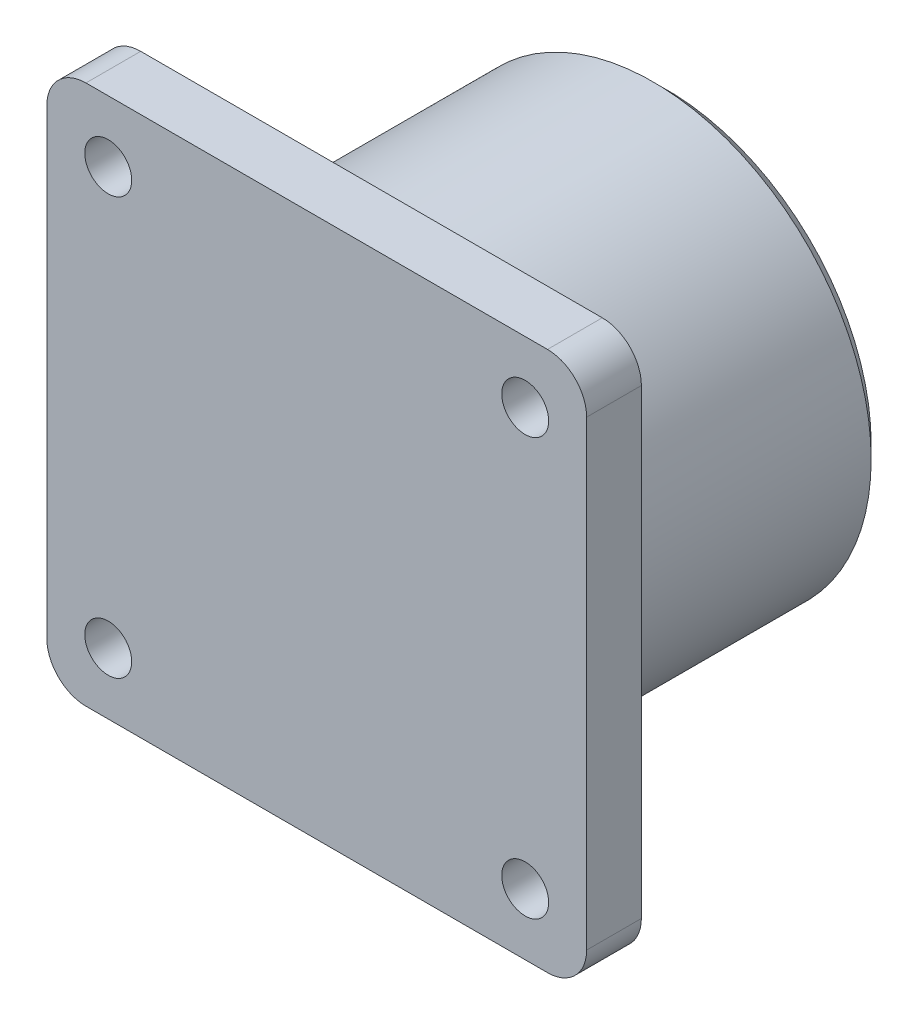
ISO-10303-21;
HEADER;
FILE_DESCRIPTION(('STEP AP214'),'2;1');
FILE_NAME('part.step','',(''),(''),'','','');
FILE_SCHEMA(('AUTOMOTIVE_DESIGN { 1 0 10303 214 1 1 1 1 }'));
ENDSEC;
DATA;
#1=APPLICATION_CONTEXT('core data for automotive mechanical design processes');
#2=APPLICATION_PROTOCOL_DEFINITION('international standard','automotive_design',2000,#1);
#3=PRODUCT_CONTEXT('',#1,'mechanical');
#4=PRODUCT('Part','Part','',(#3));
#5=PRODUCT_RELATED_PRODUCT_CATEGORY('part','',(#4));
#6=PRODUCT_DEFINITION_FORMATION('','',#4);
#7=PRODUCT_DEFINITION_CONTEXT('part definition',#1,'design');
#8=PRODUCT_DEFINITION('design','',#6,#7);
#9=PRODUCT_DEFINITION_SHAPE('','',#8);
#10=(LENGTH_UNIT() NAMED_UNIT(*) SI_UNIT(.MILLI.,.METRE.));
#11=(NAMED_UNIT(*) PLANE_ANGLE_UNIT() SI_UNIT($,.RADIAN.));
#12=(NAMED_UNIT(*) SI_UNIT($,.STERADIAN.) SOLID_ANGLE_UNIT());
#13=UNCERTAINTY_MEASURE_WITH_UNIT(LENGTH_MEASURE(1.E-05),#10,'distance_accuracy_value','');
#14=(GEOMETRIC_REPRESENTATION_CONTEXT(3) GLOBAL_UNCERTAINTY_ASSIGNED_CONTEXT((#13)) GLOBAL_UNIT_ASSIGNED_CONTEXT((#10,
#11,#12)) REPRESENTATION_CONTEXT('',''));
#15=CARTESIAN_POINT('',(0.,0.,0.));
#16=DIRECTION('',(0.,0.,1.));
#17=DIRECTION('',(1.,0.,0.));
#18=AXIS2_PLACEMENT_3D('',#15,#16,#17);
#19=CARTESIAN_POINT('',(0.,0.,19.177));
#20=DIRECTION('',(0.,0.,-1.));
#21=DIRECTION('',(-1.,0.,0.));
#22=AXIS2_PLACEMENT_3D('',#19,#20,#21);
#23=CYLINDRICAL_SURFACE('',#22,14.1605);
#24=CARTESIAN_POINT('',(0.,0.,0.889000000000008));
#25=DIRECTION('',(0.,0.,1.));
#26=DIRECTION('',(1.,0.,0.));
#27=AXIS2_PLACEMENT_3D('',#24,#25,#26);
#28=CIRCLE('',#27,14.1605);
#29=CARTESIAN_POINT('',(-14.1605,0.,0.889000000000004));
#30=VERTEX_POINT('',#29);
#31=EDGE_CURVE('E226',#30,#30,#28,.T.);
#32=CARTESIAN_POINT('',(0.,0.,19.177));
#33=DIRECTION('',(0.,0.,1.));
#34=DIRECTION('',(1.,0.,0.));
#35=AXIS2_PLACEMENT_3D('',#32,#33,#34);
#36=CIRCLE('',#35,14.1605);
#37=CARTESIAN_POINT('',(-14.1605,0.,19.177));
#38=VERTEX_POINT('',#37);
#39=EDGE_CURVE('E187',#38,#38,#36,.T.);
#40=CARTESIAN_POINT('',(-14.1605,0.,0.889000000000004));
#41=CARTESIAN_POINT('',(-14.1605,0.,1.0795));
#42=CARTESIAN_POINT('',(-14.1605,0.,1.27));
#43=CARTESIAN_POINT('',(-14.1605,0.,1.651));
#44=CARTESIAN_POINT('',(-14.1605,0.,1.8415));
#45=CARTESIAN_POINT('',(-14.1605,0.,2.2225));
#46=CARTESIAN_POINT('',(-14.1605,0.,2.413));
#47=CARTESIAN_POINT('',(-14.1605,0.,2.794));
#48=CARTESIAN_POINT('',(-14.1605,0.,2.9845));
#49=CARTESIAN_POINT('',(-14.1605,0.,3.3655));
#50=CARTESIAN_POINT('',(-14.1605,0.,3.556));
#51=CARTESIAN_POINT('',(-14.1605,0.,3.937));
#52=CARTESIAN_POINT('',(-14.1605,0.,4.1275));
#53=CARTESIAN_POINT('',(-14.1605,0.,4.5085));
#54=CARTESIAN_POINT('',(-14.1605,0.,4.699));
#55=CARTESIAN_POINT('',(-14.1605,0.,5.08));
#56=CARTESIAN_POINT('',(-14.1605,0.,5.2705));
#57=CARTESIAN_POINT('',(-14.1605,0.,5.6515));
#58=CARTESIAN_POINT('',(-14.1605,0.,5.842));
#59=CARTESIAN_POINT('',(-14.1605,0.,6.223));
#60=CARTESIAN_POINT('',(-14.1605,0.,6.4135));
#61=CARTESIAN_POINT('',(-14.1605,0.,6.7945));
#62=CARTESIAN_POINT('',(-14.1605,0.,6.985));
#63=CARTESIAN_POINT('',(-14.1605,0.,7.366));
#64=CARTESIAN_POINT('',(-14.1605,0.,7.5565));
#65=CARTESIAN_POINT('',(-14.1605,0.,7.9375));
#66=CARTESIAN_POINT('',(-14.1605,0.,8.128));
#67=CARTESIAN_POINT('',(-14.1605,0.,8.509));
#68=CARTESIAN_POINT('',(-14.1605,0.,8.6995));
#69=CARTESIAN_POINT('',(-14.1605,0.,9.0805));
#70=CARTESIAN_POINT('',(-14.1605,0.,9.271));
#71=CARTESIAN_POINT('',(-14.1605,0.,9.652));
#72=CARTESIAN_POINT('',(-14.1605,0.,9.8425));
#73=CARTESIAN_POINT('',(-14.1605,0.,10.2235));
#74=CARTESIAN_POINT('',(-14.1605,0.,10.414));
#75=CARTESIAN_POINT('',(-14.1605,0.,10.795));
#76=CARTESIAN_POINT('',(-14.1605,0.,10.9855));
#77=CARTESIAN_POINT('',(-14.1605,0.,11.3665));
#78=CARTESIAN_POINT('',(-14.1605,0.,11.557));
#79=CARTESIAN_POINT('',(-14.1605,0.,11.938));
#80=CARTESIAN_POINT('',(-14.1605,0.,12.1285));
#81=CARTESIAN_POINT('',(-14.1605,0.,12.5095));
#82=CARTESIAN_POINT('',(-14.1605,0.,12.7));
#83=CARTESIAN_POINT('',(-14.1605,0.,13.081));
#84=CARTESIAN_POINT('',(-14.1605,0.,13.2715));
#85=CARTESIAN_POINT('',(-14.1605,0.,13.6525));
#86=CARTESIAN_POINT('',(-14.1605,0.,13.843));
#87=CARTESIAN_POINT('',(-14.1605,0.,14.224));
#88=CARTESIAN_POINT('',(-14.1605,0.,14.4145));
#89=CARTESIAN_POINT('',(-14.1605,0.,14.7955));
#90=CARTESIAN_POINT('',(-14.1605,0.,14.986));
#91=CARTESIAN_POINT('',(-14.1605,0.,15.367));
#92=CARTESIAN_POINT('',(-14.1605,0.,15.5575));
#93=CARTESIAN_POINT('',(-14.1605,0.,15.9385));
#94=CARTESIAN_POINT('',(-14.1605,0.,16.129));
#95=CARTESIAN_POINT('',(-14.1605,0.,16.51));
#96=CARTESIAN_POINT('',(-14.1605,0.,16.7005));
#97=CARTESIAN_POINT('',(-14.1605,0.,17.0815));
#98=CARTESIAN_POINT('',(-14.1605,0.,17.272));
#99=CARTESIAN_POINT('',(-14.1605,0.,17.653));
#100=CARTESIAN_POINT('',(-14.1605,0.,17.8435));
#101=CARTESIAN_POINT('',(-14.1605,0.,18.2245));
#102=CARTESIAN_POINT('',(-14.1605,0.,18.415));
#103=CARTESIAN_POINT('',(-14.1605,0.,18.796));
#104=CARTESIAN_POINT('',(-14.1605,0.,18.9865));
#105=CARTESIAN_POINT('',(-14.1605,0.,19.177));
#106=B_SPLINE_CURVE_WITH_KNOTS('',3,(#40,#41,#42,#43,#44,#45,#46,#47,#48,#49,#50,#51,#52,#53,
#54,#55,#56,#57,#58,#59,#60,#61,#62,#63,#64,#65,#66,#67,#68,#69,#70,#71,#72,#73,#74,#75,#76,#77,
#78,#79,#80,#81,#82,#83,#84,#85,#86,#87,#88,#89,#90,#91,#92,#93,#94,#95,#96,#97,#98,#99,#100,
#101,#102,#103,#104,#105),.UNSPECIFIED.,.F.,.F.,(4,2,2,2,2,2,2,2,2,2,2,2,2,2,2,2,2,2,2,2,2,2,2,
2,2,2,2,2,2,2,2,2,4),(0.,0.571499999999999,1.143,1.7145,2.286,2.8575,3.429,4.0005,4.572,5.1435,
5.715,6.2865,6.858,7.4295,8.001,8.5725,9.144,9.7155,10.287,10.8585,11.43,12.0015,12.573,13.1445,
13.716,14.2875,14.859,15.4305,16.002,16.5735,17.145,17.7165,18.288),.UNSPECIFIED.);
#107=EDGE_CURVE('BSEAM16',#30,#38,#106,.T.);
#108=ORIENTED_EDGE('',*,*,#31,.T.);
#109=ORIENTED_EDGE('',*,*,#39,.F.);
#110=ORIENTED_EDGE('',*,*,#107,.T.);
#111=ORIENTED_EDGE('',*,*,#107,.F.);
#112=EDGE_LOOP('',(#108,#110,#109,#111));
#113=FACE_BOUND('',#112,.T.);
#114=ADVANCED_FACE('F16',(#113),#23,.T.);
#115=CARTESIAN_POINT('',(0.,0.,0.));
#116=DIRECTION('',(0.,0.,1.));
#117=DIRECTION('',(1.,0.,0.));
#118=AXIS2_PLACEMENT_3D('',#115,#116,#117);
#119=PLANE('',#118);
#120=CARTESIAN_POINT('',(0.,0.,0.));
#121=DIRECTION('',(0.,0.,-1.));
#122=DIRECTION('',(-1.,0.,0.));
#123=AXIS2_PLACEMENT_3D('',#120,#121,#122);
#124=CIRCLE('',#123,12.0015);
#125=CARTESIAN_POINT('',(-12.0015,0.,0.));
#126=VERTEX_POINT('',#125);
#127=EDGE_CURVE('E133',#126,#126,#124,.T.);
#128=ORIENTED_EDGE('',*,*,#127,.F.);
#129=EDGE_LOOP('',(#128));
#130=FACE_BOUND('',#129,.T.);
#131=CARTESIAN_POINT('',(0.,0.,0.));
#132=DIRECTION('',(0.,0.,1.));
#133=DIRECTION('',(1.,0.,0.));
#134=AXIS2_PLACEMENT_3D('',#131,#132,#133);
#135=CIRCLE('',#134,13.2715);
#136=CARTESIAN_POINT('',(13.2715,0.,0.));
#137=VERTEX_POINT('',#136);
#138=EDGE_CURVE('E229',#137,#137,#135,.F.);
#139=ORIENTED_EDGE('',*,*,#138,.T.);
#140=EDGE_LOOP('',(#139));
#141=FACE_BOUND('',#140,.T.);
#142=ADVANCED_FACE('F305',(#130,#141),#119,.F.);
#143=CARTESIAN_POINT('',(-17.526,-17.526,19.177));
#144=DIRECTION('',(0.,0.,1.));
#145=DIRECTION('',(1.,0.,0.));
#146=AXIS2_PLACEMENT_3D('',#143,#144,#145);
#147=PLANE('',#146);
#148=CARTESIAN_POINT('',(-13.5381999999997,-13.5382,19.177));
#149=DIRECTION('',(0.,0.,1.));
#150=DIRECTION('',(1.,0.,0.));
#151=AXIS2_PLACEMENT_3D('',#148,#149,#150);
#152=CIRCLE('',#151,1.524);
#153=CARTESIAN_POINT('',(-12.0141999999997,-13.5382,19.177));
#154=VERTEX_POINT('',#153);
#155=EDGE_CURVE('E142',#154,#154,#152,.T.);
#156=ORIENTED_EDGE('',*,*,#155,.T.);
#157=EDGE_LOOP('',(#156));
#158=FACE_BOUND('',#157,.T.);
#159=CARTESIAN_POINT('',(13.5382000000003,-13.5381999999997,19.177));
#160=DIRECTION('',(0.,0.,1.));
#161=DIRECTION('',(1.,0.,0.));
#162=AXIS2_PLACEMENT_3D('',#159,#160,#161);
#163=CIRCLE('',#162,1.524);
#164=CARTESIAN_POINT('',(15.0622000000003,-13.5381999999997,19.177));
#165=VERTEX_POINT('',#164);
#166=EDGE_CURVE('E148',#165,#165,#163,.T.);
#167=ORIENTED_EDGE('',*,*,#166,.T.);
#168=EDGE_LOOP('',(#167));
#169=FACE_BOUND('',#168,.T.);
#170=CARTESIAN_POINT('',(13.5382,13.5382000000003,19.177));
#171=DIRECTION('',(0.,0.,1.));
#172=DIRECTION('',(1.,0.,0.));
#173=AXIS2_PLACEMENT_3D('',#170,#171,#172);
#174=CIRCLE('',#173,1.524);
#175=CARTESIAN_POINT('',(15.0622,13.5382000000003,19.177));
#176=VERTEX_POINT('',#175);
#177=EDGE_CURVE('E154',#176,#176,#174,.T.);
#178=ORIENTED_EDGE('',*,*,#177,.T.);
#179=EDGE_LOOP('',(#178));
#180=FACE_BOUND('',#179,.T.);
#181=CARTESIAN_POINT('',(-13.5382,13.5382,19.177));
#182=DIRECTION('',(0.,0.,1.));
#183=DIRECTION('',(1.,0.,0.));
#184=AXIS2_PLACEMENT_3D('',#181,#182,#183);
#185=CIRCLE('',#184,1.524);
#186=CARTESIAN_POINT('',(-12.0142,13.5382,19.177));
#187=VERTEX_POINT('',#186);
#188=EDGE_CURVE('E160',#187,#187,#185,.T.);
#189=ORIENTED_EDGE('',*,*,#188,.T.);
#190=EDGE_LOOP('',(#189));
#191=FACE_BOUND('',#190,.T.);
#192=DIRECTION('',(1.,0.,0.));
#193=VECTOR('',#192,1.);
#194=CARTESIAN_POINT('',(-17.526,-17.526,19.177));
#195=LINE('',#194,#193);
#196=CARTESIAN_POINT('',(-14.986,-17.526,19.177));
#197=VERTEX_POINT('',#196);
#198=CARTESIAN_POINT('',(14.986,-17.526,19.177));
#199=VERTEX_POINT('',#198);
#200=EDGE_CURVE('E166',#197,#199,#195,.T.);
#201=ORIENTED_EDGE('',*,*,#200,.F.);
#202=CARTESIAN_POINT('',(-14.986,-14.986,19.177));
#203=DIRECTION('',(0.,0.,1.));
#204=DIRECTION('',(1.,0.,0.));
#205=AXIS2_PLACEMENT_3D('',#202,#203,#204);
#206=CIRCLE('',#205,2.54);
#207=CARTESIAN_POINT('',(-17.526,-14.986,19.177));
#208=VERTEX_POINT('',#207);
#209=EDGE_CURVE('E201',#197,#208,#206,.F.);
#210=ORIENTED_EDGE('',*,*,#209,.T.);
#211=DIRECTION('',(0.,-1.,0.));
#212=VECTOR('',#211,1.);
#213=CARTESIAN_POINT('',(-17.526,17.526,19.177));
#214=LINE('',#213,#212);
#215=CARTESIAN_POINT('',(-17.526,14.986,19.177));
#216=VERTEX_POINT('',#215);
#217=EDGE_CURVE('E163',#216,#208,#214,.T.);
#218=ORIENTED_EDGE('',*,*,#217,.F.);
#219=CARTESIAN_POINT('',(-14.986,14.986,19.177));
#220=DIRECTION('',(0.,0.,1.));
#221=DIRECTION('',(1.,0.,0.));
#222=AXIS2_PLACEMENT_3D('',#219,#220,#221);
#223=CIRCLE('',#222,2.54);
#224=CARTESIAN_POINT('',(-14.986,17.526,19.177));
#225=VERTEX_POINT('',#224);
#226=EDGE_CURVE('E197',#216,#225,#223,.F.);
#227=ORIENTED_EDGE('',*,*,#226,.T.);
#228=DIRECTION('',(-1.,0.,0.));
#229=VECTOR('',#228,1.);
#230=CARTESIAN_POINT('',(-17.526,17.526,19.177));
#231=LINE('',#230,#229);
#232=CARTESIAN_POINT('',(14.986,17.526,19.177));
#233=VERTEX_POINT('',#232);
#234=EDGE_CURVE('E172',#233,#225,#231,.T.);
#235=ORIENTED_EDGE('',*,*,#234,.F.);
#236=CARTESIAN_POINT('',(14.986,14.986,19.177));
#237=DIRECTION('',(0.,0.,1.));
#238=DIRECTION('',(1.,0.,0.));
#239=AXIS2_PLACEMENT_3D('',#236,#237,#238);
#240=CIRCLE('',#239,2.54);
#241=CARTESIAN_POINT('',(17.526,14.986,19.177));
#242=VERTEX_POINT('',#241);
#243=EDGE_CURVE('E195',#233,#242,#240,.F.);
#244=ORIENTED_EDGE('',*,*,#243,.T.);
#245=DIRECTION('',(0.,1.,0.));
#246=VECTOR('',#245,1.);
#247=CARTESIAN_POINT('',(17.526,17.526,19.177));
#248=LINE('',#247,#246);
#249=CARTESIAN_POINT('',(17.526,-14.986,19.177));
#250=VERTEX_POINT('',#249);
#251=EDGE_CURVE('E169',#250,#242,#248,.T.);
#252=ORIENTED_EDGE('',*,*,#251,.F.);
#253=CARTESIAN_POINT('',(14.986,-14.986,19.177));
#254=DIRECTION('',(0.,0.,1.));
#255=DIRECTION('',(1.,0.,0.));
#256=AXIS2_PLACEMENT_3D('',#253,#254,#255);
#257=CIRCLE('',#256,2.54);
#258=EDGE_CURVE('E199',#250,#199,#257,.F.);
#259=ORIENTED_EDGE('',*,*,#258,.T.);
#260=EDGE_LOOP('',(#201,#210,#218,#227,#235,#244,#252,#259));
#261=FACE_BOUND('',#260,.T.);
#262=ORIENTED_EDGE('',*,*,#39,.T.);
#263=EDGE_LOOP('',(#262));
#264=FACE_BOUND('',#263,.T.);
#265=ADVANCED_FACE('F310',(#158,#169,#180,#191,#261,#264),#147,.F.);
#266=CARTESIAN_POINT('',(-17.526,17.526,22.733));
#267=DIRECTION('',(1.,0.,0.));
#268=DIRECTION('',(0.,1.,0.));
#269=AXIS2_PLACEMENT_3D('',#266,#267,#268);
#270=PLANE('',#269);
#271=ORIENTED_EDGE('',*,*,#217,.T.);
#272=DIRECTION('',(0.,0.,-1.));
#273=VECTOR('',#272,1.);
#274=CARTESIAN_POINT('',(-17.526,-14.986,22.733));
#275=LINE('',#274,#273);
#276=CARTESIAN_POINT('',(-17.526,-14.986,22.733));
#277=VERTEX_POINT('',#276);
#278=EDGE_CURVE('E206',#208,#277,#275,.F.);
#279=ORIENTED_EDGE('',*,*,#278,.T.);
#280=DIRECTION('',(0.,-1.,0.));
#281=VECTOR('',#280,1.);
#282=CARTESIAN_POINT('',(-17.526,17.526,22.733));
#283=LINE('',#282,#281);
#284=CARTESIAN_POINT('',(-17.526,14.986,22.733));
#285=VERTEX_POINT('',#284);
#286=EDGE_CURVE('E175',#285,#277,#283,.T.);
#287=ORIENTED_EDGE('',*,*,#286,.F.);
#288=DIRECTION('',(0.,0.,-1.));
#289=VECTOR('',#288,1.);
#290=CARTESIAN_POINT('',(-17.526,14.986,22.733));
#291=LINE('',#290,#289);
#292=EDGE_CURVE('E203',#285,#216,#291,.T.);
#293=ORIENTED_EDGE('',*,*,#292,.T.);
#294=EDGE_LOOP('',(#271,#279,#287,#293));
#295=FACE_BOUND('',#294,.T.);
#296=ADVANCED_FACE('F317',(#295),#270,.F.);
#297=CARTESIAN_POINT('',(-17.526,-17.526,22.733));
#298=DIRECTION('',(0.,1.,0.));
#299=DIRECTION('',(0.,0.,1.));
#300=AXIS2_PLACEMENT_3D('',#297,#298,#299);
#301=PLANE('',#300);
#302=DIRECTION('',(1.,0.,0.));
#303=VECTOR('',#302,1.);
#304=CARTESIAN_POINT('',(-17.526,-17.526,22.733));
#305=LINE('',#304,#303);
#306=CARTESIAN_POINT('',(-14.986,-17.526,22.733));
#307=VERTEX_POINT('',#306);
#308=CARTESIAN_POINT('',(14.986,-17.526,22.733));
#309=VERTEX_POINT('',#308);
#310=EDGE_CURVE('E178',#307,#309,#305,.T.);
#311=ORIENTED_EDGE('',*,*,#310,.F.);
#312=DIRECTION('',(0.,0.,-1.));
#313=VECTOR('',#312,1.);
#314=CARTESIAN_POINT('',(-14.986,-17.526,22.733));
#315=LINE('',#314,#313);
#316=EDGE_CURVE('E192',#307,#197,#315,.T.);
#317=ORIENTED_EDGE('',*,*,#316,.T.);
#318=ORIENTED_EDGE('',*,*,#200,.T.);
#319=DIRECTION('',(0.,0.,-1.));
#320=VECTOR('',#319,1.);
#321=CARTESIAN_POINT('',(14.986,-17.526,22.733));
#322=LINE('',#321,#320);
#323=EDGE_CURVE('E190',#199,#309,#322,.F.);
#324=ORIENTED_EDGE('',*,*,#323,.T.);
#325=EDGE_LOOP('',(#311,#317,#318,#324));
#326=FACE_BOUND('',#325,.T.);
#327=ADVANCED_FACE('F323',(#326),#301,.F.);
#328=CARTESIAN_POINT('',(17.526,17.526,22.733));
#329=DIRECTION('',(-1.,0.,0.));
#330=DIRECTION('',(0.,-1.,0.));
#331=AXIS2_PLACEMENT_3D('',#328,#329,#330);
#332=PLANE('',#331);
#333=DIRECTION('',(0.,1.,0.));
#334=VECTOR('',#333,1.);
#335=CARTESIAN_POINT('',(17.526,17.526,22.733));
#336=LINE('',#335,#334);
#337=CARTESIAN_POINT('',(17.526,-14.986,22.733));
#338=VERTEX_POINT('',#337);
#339=CARTESIAN_POINT('',(17.526,14.986,22.733));
#340=VERTEX_POINT('',#339);
#341=EDGE_CURVE('E181',#338,#340,#336,.T.);
#342=ORIENTED_EDGE('',*,*,#341,.F.);
#343=DIRECTION('',(0.,0.,-1.));
#344=VECTOR('',#343,1.);
#345=CARTESIAN_POINT('',(17.526,-14.986,22.733));
#346=LINE('',#345,#344);
#347=EDGE_CURVE('E218',#338,#250,#346,.T.);
#348=ORIENTED_EDGE('',*,*,#347,.T.);
#349=ORIENTED_EDGE('',*,*,#251,.T.);
#350=DIRECTION('',(0.,0.,-1.));
#351=VECTOR('',#350,1.);
#352=CARTESIAN_POINT('',(17.526,14.986,22.733));
#353=LINE('',#352,#351);
#354=EDGE_CURVE('E216',#242,#340,#353,.F.);
#355=ORIENTED_EDGE('',*,*,#354,.T.);
#356=EDGE_LOOP('',(#342,#348,#349,#355));
#357=FACE_BOUND('',#356,.T.);
#358=ADVANCED_FACE('F338',(#357),#332,.F.);
#359=CARTESIAN_POINT('',(-17.526,17.526,22.733));
#360=DIRECTION('',(0.,-1.,0.));
#361=DIRECTION('',(0.,0.,-1.));
#362=AXIS2_PLACEMENT_3D('',#359,#360,#361);
#363=PLANE('',#362);
#364=ORIENTED_EDGE('',*,*,#234,.T.);
#365=DIRECTION('',(0.,0.,-1.));
#366=VECTOR('',#365,1.);
#367=CARTESIAN_POINT('',(-14.986,17.526,22.733));
#368=LINE('',#367,#366);
#369=CARTESIAN_POINT('',(-14.986,17.526,22.733));
#370=VERTEX_POINT('',#369);
#371=EDGE_CURVE('E224',#225,#370,#368,.F.);
#372=ORIENTED_EDGE('',*,*,#371,.T.);
#373=DIRECTION('',(-1.,0.,0.));
#374=VECTOR('',#373,1.);
#375=CARTESIAN_POINT('',(-17.526,17.526,22.733));
#376=LINE('',#375,#374);
#377=CARTESIAN_POINT('',(14.986,17.526,22.733));
#378=VERTEX_POINT('',#377);
#379=EDGE_CURVE('E184',#378,#370,#376,.T.);
#380=ORIENTED_EDGE('',*,*,#379,.F.);
#381=DIRECTION('',(0.,0.,-1.));
#382=VECTOR('',#381,1.);
#383=CARTESIAN_POINT('',(14.986,17.526,22.733));
#384=LINE('',#383,#382);
#385=EDGE_CURVE('E221',#378,#233,#384,.T.);
#386=ORIENTED_EDGE('',*,*,#385,.T.);
#387=EDGE_LOOP('',(#364,#372,#380,#386));
#388=FACE_BOUND('',#387,.T.);
#389=ADVANCED_FACE('F334',(#388),#363,.F.);
#390=CARTESIAN_POINT('',(-17.526,-17.526,22.733));
#391=DIRECTION('',(0.,0.,1.));
#392=DIRECTION('',(1.,0.,0.));
#393=AXIS2_PLACEMENT_3D('',#390,#391,#392);
#394=PLANE('',#393);
#395=CARTESIAN_POINT('',(-13.5381999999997,-13.5382,22.733));
#396=DIRECTION('',(0.,0.,1.));
#397=DIRECTION('',(1.,0.,0.));
#398=AXIS2_PLACEMENT_3D('',#395,#396,#397);
#399=CIRCLE('',#398,1.524);
#400=CARTESIAN_POINT('',(-12.0141999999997,-13.5382,22.733));
#401=VERTEX_POINT('',#400);
#402=EDGE_CURVE('E139',#401,#401,#399,.T.);
#403=ORIENTED_EDGE('',*,*,#402,.F.);
#404=EDGE_LOOP('',(#403));
#405=FACE_BOUND('',#404,.T.);
#406=CARTESIAN_POINT('',(13.5382000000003,-13.5381999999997,22.733));
#407=DIRECTION('',(0.,0.,1.));
#408=DIRECTION('',(1.,0.,0.));
#409=AXIS2_PLACEMENT_3D('',#406,#407,#408);
#410=CIRCLE('',#409,1.524);
#411=CARTESIAN_POINT('',(15.0622000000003,-13.5381999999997,22.733));
#412=VERTEX_POINT('',#411);
#413=EDGE_CURVE('E145',#412,#412,#410,.T.);
#414=ORIENTED_EDGE('',*,*,#413,.F.);
#415=EDGE_LOOP('',(#414));
#416=FACE_BOUND('',#415,.T.);
#417=CARTESIAN_POINT('',(13.5382,13.5382000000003,22.733));
#418=DIRECTION('',(0.,0.,1.));
#419=DIRECTION('',(1.,0.,0.));
#420=AXIS2_PLACEMENT_3D('',#417,#418,#419);
#421=CIRCLE('',#420,1.524);
#422=CARTESIAN_POINT('',(15.0622,13.5382000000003,22.733));
#423=VERTEX_POINT('',#422);
#424=EDGE_CURVE('E151',#423,#423,#421,.T.);
#425=ORIENTED_EDGE('',*,*,#424,.F.);
#426=EDGE_LOOP('',(#425));
#427=FACE_BOUND('',#426,.T.);
#428=CARTESIAN_POINT('',(-13.5382,13.5382,22.733));
#429=DIRECTION('',(0.,0.,1.));
#430=DIRECTION('',(1.,0.,0.));
#431=AXIS2_PLACEMENT_3D('',#428,#429,#430);
#432=CIRCLE('',#431,1.524);
#433=CARTESIAN_POINT('',(-12.0142,13.5382,22.733));
#434=VERTEX_POINT('',#433);
#435=EDGE_CURVE('E157',#434,#434,#432,.T.);
#436=ORIENTED_EDGE('',*,*,#435,.F.);
#437=EDGE_LOOP('',(#436));
#438=FACE_BOUND('',#437,.T.);
#439=ORIENTED_EDGE('',*,*,#286,.T.);
#440=CARTESIAN_POINT('',(-14.986,-14.986,22.733));
#441=DIRECTION('',(0.,0.,1.));
#442=DIRECTION('',(1.,0.,0.));
#443=AXIS2_PLACEMENT_3D('',#440,#441,#442);
#444=CIRCLE('',#443,2.54);
#445=EDGE_CURVE('E214',#277,#307,#444,.T.);
#446=ORIENTED_EDGE('',*,*,#445,.T.);
#447=ORIENTED_EDGE('',*,*,#310,.T.);
#448=CARTESIAN_POINT('',(14.986,-14.986,22.733));
#449=DIRECTION('',(0.,0.,1.));
#450=DIRECTION('',(1.,0.,0.));
#451=AXIS2_PLACEMENT_3D('',#448,#449,#450);
#452=CIRCLE('',#451,2.54);
#453=EDGE_CURVE('E212',#309,#338,#452,.T.);
#454=ORIENTED_EDGE('',*,*,#453,.T.);
#455=ORIENTED_EDGE('',*,*,#341,.T.);
#456=CARTESIAN_POINT('',(14.986,14.986,22.733));
#457=DIRECTION('',(0.,0.,1.));
#458=DIRECTION('',(1.,0.,0.));
#459=AXIS2_PLACEMENT_3D('',#456,#457,#458);
#460=CIRCLE('',#459,2.54);
#461=EDGE_CURVE('E208',#340,#378,#460,.T.);
#462=ORIENTED_EDGE('',*,*,#461,.T.);
#463=ORIENTED_EDGE('',*,*,#379,.T.);
#464=CARTESIAN_POINT('',(-14.986,14.986,22.733));
#465=DIRECTION('',(0.,0.,1.));
#466=DIRECTION('',(1.,0.,0.));
#467=AXIS2_PLACEMENT_3D('',#464,#465,#466);
#468=CIRCLE('',#467,2.54);
#469=EDGE_CURVE('E210',#370,#285,#468,.T.);
#470=ORIENTED_EDGE('',*,*,#469,.T.);
#471=EDGE_LOOP('',(#439,#446,#447,#454,#455,#462,#463,#470));
#472=FACE_BOUND('',#471,.T.);
#473=ADVANCED_FACE('F331',(#405,#416,#427,#438,#472),#394,.T.);
#474=CARTESIAN_POINT('',(-14.986,-14.986,22.733));
#475=DIRECTION('',(0.,0.,-1.));
#476=DIRECTION('',(-1.,0.,0.));
#477=AXIS2_PLACEMENT_3D('',#474,#475,#476);
#478=CYLINDRICAL_SURFACE('',#477,2.54);
#479=ORIENTED_EDGE('',*,*,#445,.F.);
#480=ORIENTED_EDGE('',*,*,#278,.F.);
#481=ORIENTED_EDGE('',*,*,#209,.F.);
#482=ORIENTED_EDGE('',*,*,#316,.F.);
#483=EDGE_LOOP('',(#479,#480,#481,#482));
#484=FACE_BOUND('',#483,.T.);
#485=ADVANCED_FACE('F329',(#484),#478,.T.);
#486=CARTESIAN_POINT('',(14.986,-14.986,22.733));
#487=DIRECTION('',(0.,0.,-1.));
#488=DIRECTION('',(-1.,0.,0.));
#489=AXIS2_PLACEMENT_3D('',#486,#487,#488);
#490=CYLINDRICAL_SURFACE('',#489,2.54);
#491=ORIENTED_EDGE('',*,*,#453,.F.);
#492=ORIENTED_EDGE('',*,*,#323,.F.);
#493=ORIENTED_EDGE('',*,*,#258,.F.);
#494=ORIENTED_EDGE('',*,*,#347,.F.);
#495=EDGE_LOOP('',(#491,#492,#493,#494));
#496=FACE_BOUND('',#495,.T.);
#497=ADVANCED_FACE('F375',(#496),#490,.T.);
#498=CARTESIAN_POINT('',(-14.986,14.986,22.733));
#499=DIRECTION('',(0.,0.,-1.));
#500=DIRECTION('',(-1.,0.,0.));
#501=AXIS2_PLACEMENT_3D('',#498,#499,#500);
#502=CYLINDRICAL_SURFACE('',#501,2.54);
#503=ORIENTED_EDGE('',*,*,#469,.F.);
#504=ORIENTED_EDGE('',*,*,#371,.F.);
#505=ORIENTED_EDGE('',*,*,#226,.F.);
#506=ORIENTED_EDGE('',*,*,#292,.F.);
#507=EDGE_LOOP('',(#503,#504,#505,#506));
#508=FACE_BOUND('',#507,.T.);
#509=ADVANCED_FACE('F362',(#508),#502,.T.);
#510=CARTESIAN_POINT('',(14.986,14.986,22.733));
#511=DIRECTION('',(0.,0.,-1.));
#512=DIRECTION('',(-1.,0.,0.));
#513=AXIS2_PLACEMENT_3D('',#510,#511,#512);
#514=CYLINDRICAL_SURFACE('',#513,2.54);
#515=ORIENTED_EDGE('',*,*,#461,.F.);
#516=ORIENTED_EDGE('',*,*,#354,.F.);
#517=ORIENTED_EDGE('',*,*,#243,.F.);
#518=ORIENTED_EDGE('',*,*,#385,.F.);
#519=EDGE_LOOP('',(#515,#516,#517,#518));
#520=FACE_BOUND('',#519,.T.);
#521=ADVANCED_FACE('F369',(#520),#514,.T.);
#522=CARTESIAN_POINT('',(-13.5382,13.5382,0.));
#523=DIRECTION('',(0.,0.,1.));
#524=DIRECTION('',(1.,0.,0.));
#525=AXIS2_PLACEMENT_3D('',#522,#523,#524);
#526=CYLINDRICAL_SURFACE('',#525,1.524);
#527=ORIENTED_EDGE('',*,*,#435,.T.);
#528=EDGE_LOOP('',(#527));
#529=FACE_BOUND('',#528,.T.);
#530=ORIENTED_EDGE('',*,*,#188,.F.);
#531=EDGE_LOOP('',(#530));
#532=FACE_BOUND('',#531,.T.);
#533=ADVANCED_FACE('F385',(#529,#532),#526,.F.);
#534=CARTESIAN_POINT('',(13.5382,13.5382000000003,0.));
#535=DIRECTION('',(0.,0.,1.));
#536=DIRECTION('',(1.,0.,0.));
#537=AXIS2_PLACEMENT_3D('',#534,#535,#536);
#538=CYLINDRICAL_SURFACE('',#537,1.524);
#539=ORIENTED_EDGE('',*,*,#424,.T.);
#540=EDGE_LOOP('',(#539));
#541=FACE_BOUND('',#540,.T.);
#542=ORIENTED_EDGE('',*,*,#177,.F.);
#543=EDGE_LOOP('',(#542));
#544=FACE_BOUND('',#543,.T.);
#545=ADVANCED_FACE('F388',(#541,#544),#538,.F.);
#546=CARTESIAN_POINT('',(13.5382000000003,-13.5381999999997,0.));
#547=DIRECTION('',(0.,0.,1.));
#548=DIRECTION('',(1.,0.,0.));
#549=AXIS2_PLACEMENT_3D('',#546,#547,#548);
#550=CYLINDRICAL_SURFACE('',#549,1.524);
#551=ORIENTED_EDGE('',*,*,#413,.T.);
#552=EDGE_LOOP('',(#551));
#553=FACE_BOUND('',#552,.T.);
#554=ORIENTED_EDGE('',*,*,#166,.F.);
#555=EDGE_LOOP('',(#554));
#556=FACE_BOUND('',#555,.T.);
#557=ADVANCED_FACE('F392',(#553,#556),#550,.F.);
#558=CARTESIAN_POINT('',(-13.5381999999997,-13.5382,0.));
#559=DIRECTION('',(0.,0.,1.));
#560=DIRECTION('',(1.,0.,0.));
#561=AXIS2_PLACEMENT_3D('',#558,#559,#560);
#562=CYLINDRICAL_SURFACE('',#561,1.524);
#563=ORIENTED_EDGE('',*,*,#402,.T.);
#564=EDGE_LOOP('',(#563));
#565=FACE_BOUND('',#564,.T.);
#566=ORIENTED_EDGE('',*,*,#155,.F.);
#567=EDGE_LOOP('',(#566));
#568=FACE_BOUND('',#567,.T.);
#569=ADVANCED_FACE('F396',(#565,#568),#562,.F.);
#570=CARTESIAN_POINT('',(0.,0.,0.889000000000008));
#571=DIRECTION('',(0.,0.,1.));
#572=DIRECTION('',(1.,0.,0.));
#573=AXIS2_PLACEMENT_3D('',#570,#571,#572);
#574=CONICAL_SURFACE('',#573,14.1605,0.785398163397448);
#575=ORIENTED_EDGE('',*,*,#138,.F.);
#576=EDGE_LOOP('',(#575));
#577=FACE_BOUND('',#576,.T.);
#578=ORIENTED_EDGE('',*,*,#31,.F.);
#579=EDGE_LOOP('',(#578));
#580=FACE_BOUND('',#579,.T.);
#581=ADVANCED_FACE('F400',(#577,#580),#574,.T.);
#582=CARTESIAN_POINT('',(0.,0.,16.51));
#583=DIRECTION('',(0.,0.,-1.));
#584=DIRECTION('',(-1.,0.,0.));
#585=AXIS2_PLACEMENT_3D('',#582,#583,#584);
#586=CYLINDRICAL_SURFACE('',#585,12.0015);
#587=CARTESIAN_POINT('',(0.,0.,6.223));
#588=DIRECTION('',(0.,0.,1.));
#589=DIRECTION('',(1.,0.,0.));
#590=AXIS2_PLACEMENT_3D('',#587,#588,#589);
#591=CIRCLE('',#590,12.0015);
#592=CARTESIAN_POINT('',(-0.787400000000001,11.9756420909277,6.223));
#593=VERTEX_POINT('',#592);
#594=CARTESIAN_POINT('',(0.787399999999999,11.9756420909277,6.223));
#595=VERTEX_POINT('',#594);
#596=EDGE_CURVE('E34',#593,#595,#591,.F.);
#597=ORIENTED_EDGE('',*,*,#596,.F.);
#598=DIRECTION('',(0.,0.,-1.));
#599=VECTOR('',#598,1.);
#600=CARTESIAN_POINT('',(-0.787400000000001,11.9756420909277,16.51));
#601=LINE('',#600,#599);
#602=CARTESIAN_POINT('',(-0.787400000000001,11.9756420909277,16.51));
#603=VERTEX_POINT('',#602);
#604=EDGE_CURVE('E108',#593,#603,#601,.F.);
#605=ORIENTED_EDGE('',*,*,#604,.T.);
#606=CARTESIAN_POINT('',(0.,0.,16.51));
#607=DIRECTION('',(0.,0.,-1.));
#608=DIRECTION('',(-1.,0.,0.));
#609=AXIS2_PLACEMENT_3D('',#606,#607,#608);
#610=CIRCLE('',#609,12.0015);
#611=CARTESIAN_POINT('',(0.787399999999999,11.9756420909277,16.51));
#612=VERTEX_POINT('',#611);
#613=EDGE_CURVE('E136',#612,#603,#610,.T.);
#614=ORIENTED_EDGE('',*,*,#613,.F.);
#615=DIRECTION('',(0.,0.,-1.));
#616=VECTOR('',#615,1.);
#617=CARTESIAN_POINT('',(0.787399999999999,11.9756420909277,16.51));
#618=LINE('',#617,#616);
#619=EDGE_CURVE('E30',#612,#595,#618,.T.);
#620=ORIENTED_EDGE('',*,*,#619,.T.);
#621=EDGE_LOOP('',(#597,#605,#614,#620));
#622=FACE_BOUND('',#621,.T.);
#623=ORIENTED_EDGE('',*,*,#127,.T.);
#624=EDGE_LOOP('',(#623));
#625=FACE_BOUND('',#624,.T.);
#626=ADVANCED_FACE('F271',(#622,#625),#586,.F.);
#627=CARTESIAN_POINT('',(0.,0.,16.51));
#628=DIRECTION('',(0.,0.,-1.));
#629=DIRECTION('',(-1.,0.,0.));
#630=AXIS2_PLACEMENT_3D('',#627,#628,#629);
#631=PLANE('',#630);
#632=CARTESIAN_POINT('',(0.,-2.50780106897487,16.51));
#633=DIRECTION('',(0.,0.,-1.));
#634=DIRECTION('',(-1.,0.,0.));
#635=AXIS2_PLACEMENT_3D('',#632,#633,#634);
#636=CIRCLE('',#635,0.9144);
#637=CARTESIAN_POINT('',(-0.9144,-2.50780106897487,16.51));
#638=VERTEX_POINT('',#637);
#639=EDGE_CURVE('E10',#638,#638,#636,.T.);
#640=ORIENTED_EDGE('',*,*,#639,.F.);
#641=EDGE_LOOP('',(#640));
#642=FACE_BOUND('',#641,.T.);
#643=CARTESIAN_POINT('',(0.,2.50780106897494,16.51));
#644=DIRECTION('',(0.,0.,-1.));
#645=DIRECTION('',(-1.,0.,0.));
#646=AXIS2_PLACEMENT_3D('',#643,#644,#645);
#647=CIRCLE('',#646,0.9144);
#648=CARTESIAN_POINT('',(-0.9144,2.50780106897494,16.51));
#649=VERTEX_POINT('',#648);
#650=EDGE_CURVE('E23',#649,#649,#647,.T.);
#651=ORIENTED_EDGE('',*,*,#650,.F.);
#652=EDGE_LOOP('',(#651));
#653=FACE_BOUND('',#652,.T.);
#654=CARTESIAN_POINT('',(-2.50780106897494,6.05436735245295,16.51));
#655=DIRECTION('',(0.,0.,-1.));
#656=DIRECTION('',(-1.,0.,0.));
#657=AXIS2_PLACEMENT_3D('',#654,#655,#656);
#658=CIRCLE('',#657,0.908683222);
#659=CARTESIAN_POINT('',(-3.41648429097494,6.05436735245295,16.51));
#660=VERTEX_POINT('',#659);
#661=EDGE_CURVE('E260',#660,#660,#658,.T.);
#662=ORIENTED_EDGE('',*,*,#661,.F.);
#663=EDGE_LOOP('',(#662));
#664=FACE_BOUND('',#663,.T.);
#665=CARTESIAN_POINT('',(-6.05436735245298,2.50780106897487,16.51));
#666=DIRECTION('',(0.,0.,-1.));
#667=DIRECTION('',(-1.,0.,0.));
#668=AXIS2_PLACEMENT_3D('',#665,#666,#667);
#669=CIRCLE('',#668,0.908683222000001);
#670=CARTESIAN_POINT('',(-6.96305057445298,2.50780106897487,16.51));
#671=VERTEX_POINT('',#670);
#672=EDGE_CURVE('E257',#671,#671,#669,.T.);
#673=ORIENTED_EDGE('',*,*,#672,.F.);
#674=EDGE_LOOP('',(#673));
#675=FACE_BOUND('',#674,.T.);
#676=CARTESIAN_POINT('',(2.50780106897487,6.05436735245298,16.51));
#677=DIRECTION('',(0.,0.,-1.));
#678=DIRECTION('',(-1.,0.,0.));
#679=AXIS2_PLACEMENT_3D('',#676,#677,#678);
#680=CIRCLE('',#679,0.908683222);
#681=CARTESIAN_POINT('',(1.59911784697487,6.05436735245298,16.51));
#682=VERTEX_POINT('',#681);
#683=EDGE_CURVE('E254',#682,#682,#680,.T.);
#684=ORIENTED_EDGE('',*,*,#683,.F.);
#685=EDGE_LOOP('',(#684));
#686=FACE_BOUND('',#685,.T.);
#687=CARTESIAN_POINT('',(-6.05436735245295,-2.50780106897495,16.51));
#688=DIRECTION('',(0.,0.,-1.));
#689=DIRECTION('',(-1.,0.,0.));
#690=AXIS2_PLACEMENT_3D('',#687,#688,#689);
#691=CIRCLE('',#690,0.908683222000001);
#692=CARTESIAN_POINT('',(-6.96305057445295,-2.50780106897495,16.51));
#693=VERTEX_POINT('',#692);
#694=EDGE_CURVE('E251',#693,#693,#691,.T.);
#695=ORIENTED_EDGE('',*,*,#694,.F.);
#696=EDGE_LOOP('',(#695));
#697=FACE_BOUND('',#696,.T.);
#698=CARTESIAN_POINT('',(-2.50780106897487,-6.05436735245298,16.51));
#699=DIRECTION('',(0.,0.,-1.));
#700=DIRECTION('',(-1.,0.,0.));
#701=AXIS2_PLACEMENT_3D('',#698,#699,#700);
#702=CIRCLE('',#701,0.908683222);
#703=CARTESIAN_POINT('',(-3.41648429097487,-6.05436735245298,16.51));
#704=VERTEX_POINT('',#703);
#705=EDGE_CURVE('E248',#704,#704,#702,.T.);
#706=ORIENTED_EDGE('',*,*,#705,.F.);
#707=EDGE_LOOP('',(#706));
#708=FACE_BOUND('',#707,.T.);
#709=CARTESIAN_POINT('',(2.50780106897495,-6.05436735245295,16.51));
#710=DIRECTION('',(0.,0.,-1.));
#711=DIRECTION('',(-1.,0.,0.));
#712=AXIS2_PLACEMENT_3D('',#709,#710,#711);
#713=CIRCLE('',#712,0.908683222);
#714=CARTESIAN_POINT('',(1.59911784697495,-6.05436735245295,16.51));
#715=VERTEX_POINT('',#714);
#716=EDGE_CURVE('E245',#715,#715,#713,.T.);
#717=ORIENTED_EDGE('',*,*,#716,.F.);
#718=EDGE_LOOP('',(#717));
#719=FACE_BOUND('',#718,.T.);
#720=CARTESIAN_POINT('',(6.05436735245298,-2.50780106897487,16.51));
#721=DIRECTION('',(0.,0.,-1.));
#722=DIRECTION('',(-1.,0.,0.));
#723=AXIS2_PLACEMENT_3D('',#720,#721,#722);
#724=CIRCLE('',#723,0.908683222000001);
#725=CARTESIAN_POINT('',(5.14568413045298,-2.50780106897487,16.51));
#726=VERTEX_POINT('',#725);
#727=EDGE_CURVE('E242',#726,#726,#724,.T.);
#728=ORIENTED_EDGE('',*,*,#727,.F.);
#729=EDGE_LOOP('',(#728));
#730=FACE_BOUND('',#729,.T.);
#731=CARTESIAN_POINT('',(6.05436735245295,2.50780106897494,16.51));
#732=DIRECTION('',(0.,0.,-1.));
#733=DIRECTION('',(-1.,0.,0.));
#734=AXIS2_PLACEMENT_3D('',#731,#732,#733);
#735=CIRCLE('',#734,0.908683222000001);
#736=CARTESIAN_POINT('',(5.14568413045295,2.50780106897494,16.51));
#737=VERTEX_POINT('',#736);
#738=EDGE_CURVE('E239',#737,#737,#735,.T.);
#739=ORIENTED_EDGE('',*,*,#738,.F.);
#740=EDGE_LOOP('',(#739));
#741=FACE_BOUND('',#740,.T.);
#742=DIRECTION('',(0.,1.,0.));
#743=VECTOR('',#742,1.);
#744=CARTESIAN_POINT('',(-0.787399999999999,0.,16.51));
#745=LINE('',#744,#743);
#746=CARTESIAN_POINT('',(-0.7874,10.1192737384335,16.51));
#747=VERTEX_POINT('',#746);
#748=EDGE_CURVE('E236',#747,#603,#745,.T.);
#749=ORIENTED_EDGE('',*,*,#748,.F.);
#750=DIRECTION('',(-1.,0.,0.));
#751=VECTOR('',#750,1.);
#752=CARTESIAN_POINT('',(0.,10.1192737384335,16.51));
#753=LINE('',#752,#751);
#754=CARTESIAN_POINT('',(0.7874,10.1192737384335,16.51));
#755=VERTEX_POINT('',#754);
#756=EDGE_CURVE('E119',#755,#747,#753,.T.);
#757=ORIENTED_EDGE('',*,*,#756,.F.);
#758=DIRECTION('',(0.,-1.,0.));
#759=VECTOR('',#758,1.);
#760=CARTESIAN_POINT('',(0.787400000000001,0.,16.51));
#761=LINE('',#760,#759);
#762=EDGE_CURVE('E233',#612,#755,#761,.T.);
#763=ORIENTED_EDGE('',*,*,#762,.F.);
#764=ORIENTED_EDGE('',*,*,#613,.T.);
#765=EDGE_LOOP('',(#749,#757,#763,#764));
#766=FACE_BOUND('',#765,.T.);
#767=ADVANCED_FACE('F268',(#642,#653,#664,#675,#686,#697,#708,#719,#730,#741,#766),#631,.T.);
#768=CARTESIAN_POINT('',(-0.7874,10.1192737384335,6.223));
#769=DIRECTION('',(0.,0.,1.));
#770=DIRECTION('',(1.,0.,0.));
#771=AXIS2_PLACEMENT_3D('',#768,#769,#770);
#772=PLANE('',#771);
#773=DIRECTION('',(0.,-1.,0.));
#774=VECTOR('',#773,1.);
#775=CARTESIAN_POINT('',(-0.787400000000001,12.73972864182,6.223));
#776=LINE('',#775,#774);
#777=CARTESIAN_POINT('',(-0.7874,10.1192737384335,6.223));
#778=VERTEX_POINT('',#777);
#779=EDGE_CURVE('E103',#593,#778,#776,.T.);
#780=ORIENTED_EDGE('',*,*,#779,.F.);
#781=ORIENTED_EDGE('',*,*,#596,.T.);
#782=DIRECTION('',(0.,1.,0.));
#783=VECTOR('',#782,1.);
#784=CARTESIAN_POINT('',(0.787399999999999,12.73972864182,6.223));
#785=LINE('',#784,#783);
#786=CARTESIAN_POINT('',(0.7874,10.1192737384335,6.223));
#787=VERTEX_POINT('',#786);
#788=EDGE_CURVE('E121',#787,#595,#785,.T.);
#789=ORIENTED_EDGE('',*,*,#788,.F.);
#790=DIRECTION('',(1.,0.,0.));
#791=VECTOR('',#790,1.);
#792=CARTESIAN_POINT('',(-0.7874,10.1192737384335,6.223));
#793=LINE('',#792,#791);
#794=EDGE_CURVE('E111',#778,#787,#793,.T.);
#795=ORIENTED_EDGE('',*,*,#794,.F.);
#796=EDGE_LOOP('',(#780,#781,#789,#795));
#797=FACE_BOUND('',#796,.T.);
#798=ADVANCED_FACE('F124',(#797),#772,.F.);
#799=CARTESIAN_POINT('',(-0.787400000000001,12.73972864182,6.223));
#800=DIRECTION('',(-1.,0.,0.));
#801=DIRECTION('',(0.,-1.,0.));
#802=AXIS2_PLACEMENT_3D('',#799,#800,#801);
#803=PLANE('',#802);
#804=ORIENTED_EDGE('',*,*,#604,.F.);
#805=ORIENTED_EDGE('',*,*,#779,.T.);
#806=DIRECTION('',(0.,0.,1.));
#807=VECTOR('',#806,1.);
#808=CARTESIAN_POINT('',(-0.7874,10.1192737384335,6.223));
#809=LINE('',#808,#807);
#810=EDGE_CURVE('E107',#778,#747,#809,.T.);
#811=ORIENTED_EDGE('',*,*,#810,.T.);
#812=ORIENTED_EDGE('',*,*,#748,.T.);
#813=EDGE_LOOP('',(#804,#805,#811,#812));
#814=FACE_BOUND('',#813,.T.);
#815=ADVANCED_FACE('F105',(#814),#803,.T.);
#816=CARTESIAN_POINT('',(0.787399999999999,12.73972864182,6.223));
#817=DIRECTION('',(1.,0.,0.));
#818=DIRECTION('',(0.,1.,0.));
#819=AXIS2_PLACEMENT_3D('',#816,#817,#818);
#820=PLANE('',#819);
#821=ORIENTED_EDGE('',*,*,#619,.F.);
#822=ORIENTED_EDGE('',*,*,#762,.T.);
#823=DIRECTION('',(0.,0.,1.));
#824=VECTOR('',#823,1.);
#825=CARTESIAN_POINT('',(0.7874,10.1192737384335,6.223));
#826=LINE('',#825,#824);
#827=EDGE_CURVE('E120',#787,#755,#826,.T.);
#828=ORIENTED_EDGE('',*,*,#827,.F.);
#829=ORIENTED_EDGE('',*,*,#788,.T.);
#830=EDGE_LOOP('',(#821,#822,#828,#829));
#831=FACE_BOUND('',#830,.T.);
#832=ADVANCED_FACE('F292',(#831),#820,.T.);
#833=CARTESIAN_POINT('',(-0.7874,10.1192737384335,6.223));
#834=DIRECTION('',(0.,-1.,0.));
#835=DIRECTION('',(0.,0.,-1.));
#836=AXIS2_PLACEMENT_3D('',#833,#834,#835);
#837=PLANE('',#836);
#838=ORIENTED_EDGE('',*,*,#827,.T.);
#839=ORIENTED_EDGE('',*,*,#756,.T.);
#840=ORIENTED_EDGE('',*,*,#810,.F.);
#841=ORIENTED_EDGE('',*,*,#794,.T.);
#842=EDGE_LOOP('',(#838,#839,#840,#841));
#843=FACE_BOUND('',#842,.T.);
#844=ADVANCED_FACE('F118',(#843),#837,.T.);
#845=CARTESIAN_POINT('',(6.05436735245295,2.50780106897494,6.223));
#846=DIRECTION('',(0.,0.,1.));
#847=DIRECTION('',(1.,0.,0.));
#848=AXIS2_PLACEMENT_3D('',#845,#846,#847);
#849=CYLINDRICAL_SURFACE('',#848,0.908683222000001);
#850=ORIENTED_EDGE('',*,*,#738,.T.);
#851=EDGE_LOOP('',(#850));
#852=FACE_BOUND('',#851,.T.);
#853=CARTESIAN_POINT('',(6.05436735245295,2.50780106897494,6.223));
#854=DIRECTION('',(0.,0.,1.));
#855=DIRECTION('',(1.,0.,0.));
#856=AXIS2_PLACEMENT_3D('',#853,#854,#855);
#857=CIRCLE('',#856,0.908683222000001);
#858=CARTESIAN_POINT('',(6.96305057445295,2.50780106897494,6.223));
#859=VERTEX_POINT('',#858);
#860=EDGE_CURVE('E112',#859,#859,#857,.T.);
#861=ORIENTED_EDGE('',*,*,#860,.T.);
#862=EDGE_LOOP('',(#861));
#863=FACE_BOUND('',#862,.T.);
#864=ADVANCED_FACE('F300',(#852,#863),#849,.T.);
#865=CARTESIAN_POINT('',(6.05436735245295,2.50780106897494,6.223));
#866=DIRECTION('',(0.,0.,1.));
#867=DIRECTION('',(1.,0.,0.));
#868=AXIS2_PLACEMENT_3D('',#865,#866,#867);
#869=PLANE('',#868);
#870=ORIENTED_EDGE('',*,*,#860,.F.);
#871=EDGE_LOOP('',(#870));
#872=FACE_BOUND('',#871,.T.);
#873=ADVANCED_FACE('F452',(#872),#869,.F.);
#874=CARTESIAN_POINT('',(6.05436735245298,-2.50780106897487,6.223));
#875=DIRECTION('',(0.,0.,1.));
#876=DIRECTION('',(1.,0.,0.));
#877=AXIS2_PLACEMENT_3D('',#874,#875,#876);
#878=CYLINDRICAL_SURFACE('',#877,0.908683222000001);
#879=ORIENTED_EDGE('',*,*,#727,.T.);
#880=EDGE_LOOP('',(#879));
#881=FACE_BOUND('',#880,.T.);
#882=CARTESIAN_POINT('',(6.05436735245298,-2.50780106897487,6.223));
#883=DIRECTION('',(0.,0.,1.));
#884=DIRECTION('',(1.,0.,0.));
#885=AXIS2_PLACEMENT_3D('',#882,#883,#884);
#886=CIRCLE('',#885,0.908683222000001);
#887=CARTESIAN_POINT('',(6.96305057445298,-2.50780106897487,6.223));
#888=VERTEX_POINT('',#887);
#889=EDGE_CURVE('E672',#888,#888,#886,.T.);
#890=ORIENTED_EDGE('',*,*,#889,.T.);
#891=EDGE_LOOP('',(#890));
#892=FACE_BOUND('',#891,.T.);
#893=ADVANCED_FACE('F462',(#881,#892),#878,.T.);
#894=CARTESIAN_POINT('',(6.05436735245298,-2.50780106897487,6.223));
#895=DIRECTION('',(0.,0.,1.));
#896=DIRECTION('',(1.,0.,0.));
#897=AXIS2_PLACEMENT_3D('',#894,#895,#896);
#898=PLANE('',#897);
#899=ORIENTED_EDGE('',*,*,#889,.F.);
#900=EDGE_LOOP('',(#899));
#901=FACE_BOUND('',#900,.T.);
#902=ADVANCED_FACE('F472',(#901),#898,.F.);
#903=CARTESIAN_POINT('',(2.50780106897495,-6.05436735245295,6.223));
#904=DIRECTION('',(0.,0.,1.));
#905=DIRECTION('',(1.,0.,0.));
#906=AXIS2_PLACEMENT_3D('',#903,#904,#905);
#907=CYLINDRICAL_SURFACE('',#906,0.908683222);
#908=ORIENTED_EDGE('',*,*,#716,.T.);
#909=EDGE_LOOP('',(#908));
#910=FACE_BOUND('',#909,.T.);
#911=CARTESIAN_POINT('',(2.50780106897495,-6.05436735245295,6.223));
#912=DIRECTION('',(0.,0.,1.));
#913=DIRECTION('',(1.,0.,0.));
#914=AXIS2_PLACEMENT_3D('',#911,#912,#913);
#915=CIRCLE('',#914,0.908683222);
#916=CARTESIAN_POINT('',(3.41648429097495,-6.05436735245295,6.223));
#917=VERTEX_POINT('',#916);
#918=EDGE_CURVE('E669',#917,#917,#915,.T.);
#919=ORIENTED_EDGE('',*,*,#918,.T.);
#920=EDGE_LOOP('',(#919));
#921=FACE_BOUND('',#920,.T.);
#922=ADVANCED_FACE('F482',(#910,#921),#907,.T.);
#923=CARTESIAN_POINT('',(2.50780106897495,-6.05436735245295,6.223));
#924=DIRECTION('',(0.,0.,1.));
#925=DIRECTION('',(1.,0.,0.));
#926=AXIS2_PLACEMENT_3D('',#923,#924,#925);
#927=PLANE('',#926);
#928=ORIENTED_EDGE('',*,*,#918,.F.);
#929=EDGE_LOOP('',(#928));
#930=FACE_BOUND('',#929,.T.);
#931=ADVANCED_FACE('F492',(#930),#927,.F.);
#932=CARTESIAN_POINT('',(-2.50780106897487,-6.05436735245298,6.223));
#933=DIRECTION('',(0.,0.,1.));
#934=DIRECTION('',(1.,0.,0.));
#935=AXIS2_PLACEMENT_3D('',#932,#933,#934);
#936=CYLINDRICAL_SURFACE('',#935,0.908683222);
#937=ORIENTED_EDGE('',*,*,#705,.T.);
#938=EDGE_LOOP('',(#937));
#939=FACE_BOUND('',#938,.T.);
#940=CARTESIAN_POINT('',(-2.50780106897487,-6.05436735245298,6.223));
#941=DIRECTION('',(0.,0.,1.));
#942=DIRECTION('',(1.,0.,0.));
#943=AXIS2_PLACEMENT_3D('',#940,#941,#942);
#944=CIRCLE('',#943,0.908683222);
#945=CARTESIAN_POINT('',(-1.59911784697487,-6.05436735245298,6.223));
#946=VERTEX_POINT('',#945);
#947=EDGE_CURVE('E666',#946,#946,#944,.T.);
#948=ORIENTED_EDGE('',*,*,#947,.T.);
#949=EDGE_LOOP('',(#948));
#950=FACE_BOUND('',#949,.T.);
#951=ADVANCED_FACE('F502',(#939,#950),#936,.T.);
#952=CARTESIAN_POINT('',(-2.50780106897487,-6.05436735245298,6.223));
#953=DIRECTION('',(0.,0.,1.));
#954=DIRECTION('',(1.,0.,0.));
#955=AXIS2_PLACEMENT_3D('',#952,#953,#954);
#956=PLANE('',#955);
#957=ORIENTED_EDGE('',*,*,#947,.F.);
#958=EDGE_LOOP('',(#957));
#959=FACE_BOUND('',#958,.T.);
#960=ADVANCED_FACE('F512',(#959),#956,.F.);
#961=CARTESIAN_POINT('',(-6.05436735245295,-2.50780106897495,6.223));
#962=DIRECTION('',(0.,0.,1.));
#963=DIRECTION('',(1.,0.,0.));
#964=AXIS2_PLACEMENT_3D('',#961,#962,#963);
#965=CYLINDRICAL_SURFACE('',#964,0.908683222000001);
#966=ORIENTED_EDGE('',*,*,#694,.T.);
#967=EDGE_LOOP('',(#966));
#968=FACE_BOUND('',#967,.T.);
#969=CARTESIAN_POINT('',(-6.05436735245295,-2.50780106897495,6.223));
#970=DIRECTION('',(0.,0.,1.));
#971=DIRECTION('',(1.,0.,0.));
#972=AXIS2_PLACEMENT_3D('',#969,#970,#971);
#973=CIRCLE('',#972,0.908683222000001);
#974=CARTESIAN_POINT('',(-5.14568413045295,-2.50780106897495,6.223));
#975=VERTEX_POINT('',#974);
#976=EDGE_CURVE('E663',#975,#975,#973,.T.);
#977=ORIENTED_EDGE('',*,*,#976,.T.);
#978=EDGE_LOOP('',(#977));
#979=FACE_BOUND('',#978,.T.);
#980=ADVANCED_FACE('F522',(#968,#979),#965,.T.);
#981=CARTESIAN_POINT('',(-6.05436735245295,-2.50780106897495,6.223));
#982=DIRECTION('',(0.,0.,1.));
#983=DIRECTION('',(1.,0.,0.));
#984=AXIS2_PLACEMENT_3D('',#981,#982,#983);
#985=PLANE('',#984);
#986=ORIENTED_EDGE('',*,*,#976,.F.);
#987=EDGE_LOOP('',(#986));
#988=FACE_BOUND('',#987,.T.);
#989=ADVANCED_FACE('F532',(#988),#985,.F.);
#990=CARTESIAN_POINT('',(2.50780106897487,6.05436735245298,6.223));
#991=DIRECTION('',(0.,0.,1.));
#992=DIRECTION('',(1.,0.,0.));
#993=AXIS2_PLACEMENT_3D('',#990,#991,#992);
#994=CYLINDRICAL_SURFACE('',#993,0.908683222);
#995=ORIENTED_EDGE('',*,*,#683,.T.);
#996=EDGE_LOOP('',(#995));
#997=FACE_BOUND('',#996,.T.);
#998=CARTESIAN_POINT('',(2.50780106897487,6.05436735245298,6.223));
#999=DIRECTION('',(0.,0.,1.));
#1000=DIRECTION('',(1.,0.,0.));
#1001=AXIS2_PLACEMENT_3D('',#998,#999,#1000);
#1002=CIRCLE('',#1001,0.908683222);
#1003=CARTESIAN_POINT('',(3.41648429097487,6.05436735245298,6.223));
#1004=VERTEX_POINT('',#1003);
#1005=EDGE_CURVE('E660',#1004,#1004,#1002,.T.);
#1006=ORIENTED_EDGE('',*,*,#1005,.T.);
#1007=EDGE_LOOP('',(#1006));
#1008=FACE_BOUND('',#1007,.T.);
#1009=ADVANCED_FACE('F542',(#997,#1008),#994,.T.);
#1010=CARTESIAN_POINT('',(2.50780106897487,6.05436735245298,6.223));
#1011=DIRECTION('',(0.,0.,1.));
#1012=DIRECTION('',(1.,0.,0.));
#1013=AXIS2_PLACEMENT_3D('',#1010,#1011,#1012);
#1014=PLANE('',#1013);
#1015=ORIENTED_EDGE('',*,*,#1005,.F.);
#1016=EDGE_LOOP('',(#1015));
#1017=FACE_BOUND('',#1016,.T.);
#1018=ADVANCED_FACE('F552',(#1017),#1014,.F.);
#1019=CARTESIAN_POINT('',(-6.05436735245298,2.50780106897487,6.223));
#1020=DIRECTION('',(0.,0.,1.));
#1021=DIRECTION('',(1.,0.,0.));
#1022=AXIS2_PLACEMENT_3D('',#1019,#1020,#1021);
#1023=CYLINDRICAL_SURFACE('',#1022,0.908683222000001);
#1024=ORIENTED_EDGE('',*,*,#672,.T.);
#1025=EDGE_LOOP('',(#1024));
#1026=FACE_BOUND('',#1025,.T.);
#1027=CARTESIAN_POINT('',(-6.05436735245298,2.50780106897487,6.223));
#1028=DIRECTION('',(0.,0.,1.));
#1029=DIRECTION('',(1.,0.,0.));
#1030=AXIS2_PLACEMENT_3D('',#1027,#1028,#1029);
#1031=CIRCLE('',#1030,0.908683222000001);
#1032=CARTESIAN_POINT('',(-5.14568413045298,2.50780106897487,6.223));
#1033=VERTEX_POINT('',#1032);
#1034=EDGE_CURVE('E657',#1033,#1033,#1031,.T.);
#1035=ORIENTED_EDGE('',*,*,#1034,.T.);
#1036=EDGE_LOOP('',(#1035));
#1037=FACE_BOUND('',#1036,.T.);
#1038=ADVANCED_FACE('F562',(#1026,#1037),#1023,.T.);
#1039=CARTESIAN_POINT('',(-6.05436735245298,2.50780106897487,6.223));
#1040=DIRECTION('',(0.,0.,1.));
#1041=DIRECTION('',(1.,0.,0.));
#1042=AXIS2_PLACEMENT_3D('',#1039,#1040,#1041);
#1043=PLANE('',#1042);
#1044=ORIENTED_EDGE('',*,*,#1034,.F.);
#1045=EDGE_LOOP('',(#1044));
#1046=FACE_BOUND('',#1045,.T.);
#1047=ADVANCED_FACE('F572',(#1046),#1043,.F.);
#1048=CARTESIAN_POINT('',(-2.50780106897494,6.05436735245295,6.223));
#1049=DIRECTION('',(0.,0.,1.));
#1050=DIRECTION('',(1.,0.,0.));
#1051=AXIS2_PLACEMENT_3D('',#1048,#1049,#1050);
#1052=CYLINDRICAL_SURFACE('',#1051,0.908683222);
#1053=ORIENTED_EDGE('',*,*,#661,.T.);
#1054=EDGE_LOOP('',(#1053));
#1055=FACE_BOUND('',#1054,.T.);
#1056=CARTESIAN_POINT('',(-2.50780106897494,6.05436735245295,6.223));
#1057=DIRECTION('',(0.,0.,1.));
#1058=DIRECTION('',(1.,0.,0.));
#1059=AXIS2_PLACEMENT_3D('',#1056,#1057,#1058);
#1060=CIRCLE('',#1059,0.908683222);
#1061=CARTESIAN_POINT('',(-1.59911784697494,6.05436735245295,6.223));
#1062=VERTEX_POINT('',#1061);
#1063=EDGE_CURVE('E652',#1062,#1062,#1060,.T.);
#1064=ORIENTED_EDGE('',*,*,#1063,.T.);
#1065=EDGE_LOOP('',(#1064));
#1066=FACE_BOUND('',#1065,.T.);
#1067=ADVANCED_FACE('F582',(#1055,#1066),#1052,.T.);
#1068=CARTESIAN_POINT('',(-2.50780106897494,6.05436735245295,6.223));
#1069=DIRECTION('',(0.,0.,1.));
#1070=DIRECTION('',(1.,0.,0.));
#1071=AXIS2_PLACEMENT_3D('',#1068,#1069,#1070);
#1072=PLANE('',#1071);
#1073=ORIENTED_EDGE('',*,*,#1063,.F.);
#1074=EDGE_LOOP('',(#1073));
#1075=FACE_BOUND('',#1074,.T.);
#1076=ADVANCED_FACE('F592',(#1075),#1072,.F.);
#1077=CARTESIAN_POINT('',(0.,2.50780106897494,6.223));
#1078=DIRECTION('',(0.,0.,1.));
#1079=DIRECTION('',(1.,0.,0.));
#1080=AXIS2_PLACEMENT_3D('',#1077,#1078,#1079);
#1081=CYLINDRICAL_SURFACE('',#1080,0.9144);
#1082=ORIENTED_EDGE('',*,*,#650,.T.);
#1083=EDGE_LOOP('',(#1082));
#1084=FACE_BOUND('',#1083,.T.);
#1085=CARTESIAN_POINT('',(0.,2.50780106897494,6.223));
#1086=DIRECTION('',(0.,0.,1.));
#1087=DIRECTION('',(1.,0.,0.));
#1088=AXIS2_PLACEMENT_3D('',#1085,#1086,#1087);
#1089=CIRCLE('',#1088,0.9144);
#1090=CARTESIAN_POINT('',(0.9144,2.50780106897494,6.223));
#1091=VERTEX_POINT('',#1090);
#1092=EDGE_CURVE('E649',#1091,#1091,#1089,.T.);
#1093=ORIENTED_EDGE('',*,*,#1092,.T.);
#1094=EDGE_LOOP('',(#1093));
#1095=FACE_BOUND('',#1094,.T.);
#1096=ADVANCED_FACE('F265',(#1084,#1095),#1081,.T.);
#1097=CARTESIAN_POINT('',(0.,2.50780106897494,6.223));
#1098=DIRECTION('',(0.,0.,1.));
#1099=DIRECTION('',(1.,0.,0.));
#1100=AXIS2_PLACEMENT_3D('',#1097,#1098,#1099);
#1101=PLANE('',#1100);
#1102=ORIENTED_EDGE('',*,*,#1092,.F.);
#1103=EDGE_LOOP('',(#1102));
#1104=FACE_BOUND('',#1103,.T.);
#1105=ADVANCED_FACE('F611',(#1104),#1101,.F.);
#1106=CARTESIAN_POINT('',(0.,-2.50780106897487,6.223));
#1107=DIRECTION('',(0.,0.,1.));
#1108=DIRECTION('',(1.,0.,0.));
#1109=AXIS2_PLACEMENT_3D('',#1106,#1107,#1108);
#1110=CYLINDRICAL_SURFACE('',#1109,0.9144);
#1111=ORIENTED_EDGE('',*,*,#639,.T.);
#1112=EDGE_LOOP('',(#1111));
#1113=FACE_BOUND('',#1112,.T.);
#1114=CARTESIAN_POINT('',(0.,-2.50780106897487,6.223));
#1115=DIRECTION('',(0.,0.,1.));
#1116=DIRECTION('',(1.,0.,0.));
#1117=AXIS2_PLACEMENT_3D('',#1114,#1115,#1116);
#1118=CIRCLE('',#1117,0.9144);
#1119=CARTESIAN_POINT('',(0.9144,-2.50780106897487,6.223));
#1120=VERTEX_POINT('',#1119);
#1121=EDGE_CURVE('E647',#1120,#1120,#1118,.T.);
#1122=ORIENTED_EDGE('',*,*,#1121,.T.);
#1123=EDGE_LOOP('',(#1122));
#1124=FACE_BOUND('',#1123,.T.);
#1125=ADVANCED_FACE('F620',(#1113,#1124),#1110,.T.);
#1126=CARTESIAN_POINT('',(0.,-2.50780106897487,6.223));
#1127=DIRECTION('',(0.,0.,1.));
#1128=DIRECTION('',(1.,0.,0.));
#1129=AXIS2_PLACEMENT_3D('',#1126,#1127,#1128);
#1130=PLANE('',#1129);
#1131=ORIENTED_EDGE('',*,*,#1121,.F.);
#1132=EDGE_LOOP('',(#1131));
#1133=FACE_BOUND('',#1132,.T.);
#1134=ADVANCED_FACE('F630',(#1133),#1130,.F.);
#1135=CLOSED_SHELL('',(#114,#142,#265,#296,#327,#358,#389,#473,#485,#497,#509,#521,#533,#545,
#557,#569,#581,#626,#767,#798,#815,#832,#844,#864,#873,#893,#902,#922,#931,#951,#960,#980,#989,
#1009,#1018,#1038,#1047,#1067,#1076,#1096,#1105,#1125,#1134));
#1136=MANIFOLD_SOLID_BREP('B1',#1135);
#1137=ADVANCED_BREP_SHAPE_REPRESENTATION('',(#18,#1136),#14);
#1138=SHAPE_DEFINITION_REPRESENTATION(#9,#1137);
ENDSEC;
END-ISO-10303-21;
